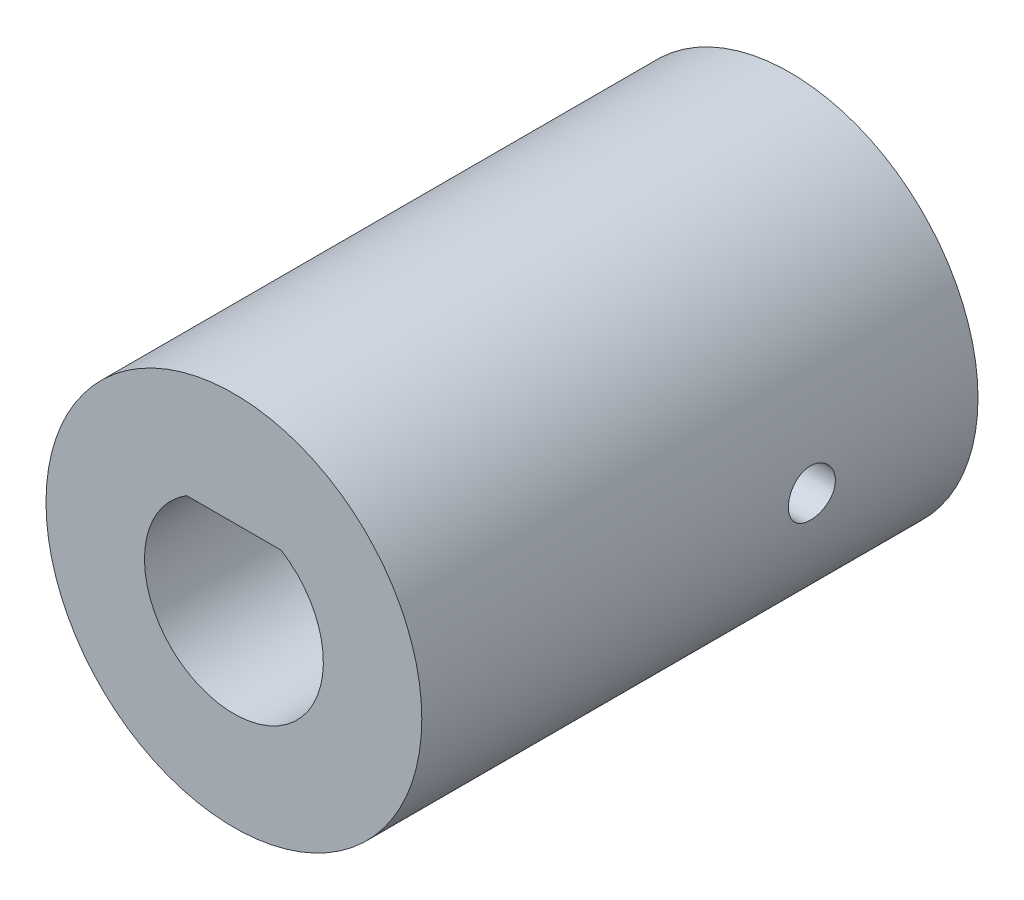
from build123d import *

# Parameters (mm, degrees)
SKETCH1_R               = 6.35
BASE_EXTRUDE_DEPTH      = 18.796
CUT_EXTRUDE1_DEPTH      = 21.831097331
CUT_EXTRUDE3_DEPTH      = 21.831097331
CUT_EXTRUDE3_DEPTH_BACK = 21.831097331
SKETCH4_R               = 0.79375


with BuildPart() as part:
    # Sketch1 → Base-Extrude (new body)
    with BuildSketch(Plane.XY):
        Circle(SKETCH1_R)
    extrude(amount=BASE_EXTRUDE_DEPTH)

    # Sketch2 → Cut-Extrude1 (cut, through all)
    with BuildSketch(Plane.XY.offset(18.796)):
        with BuildLine():
            Line((0, 2.5654), (1.598384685, 2.5654))
            ThreePointArc((1.598384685, 2.5654), (0, -3.0226), (-1.598384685, 2.5654))
            Line((-1.598384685, 2.5654), (0, 2.5654))
        make_face()
    extrude(amount=-CUT_EXTRUDE1_DEPTH, mode=Mode.SUBTRACT)

    # Sketch4 → Cut-Extrude3 (cut, two sides: drawn at the far end of the back side and taken through both)
    with BuildSketch(Plane(origin=(0, 0, 0), x_dir=(0, 0, -1), z_dir=(1, 0, 0)).offset(-CUT_EXTRUDE3_DEPTH_BACK)):
        with Locations((-5.6134, 0)):
            Circle(SKETCH4_R)
    extrude(amount=CUT_EXTRUDE3_DEPTH + CUT_EXTRUDE3_DEPTH_BACK, mode=Mode.SUBTRACT)


solid = part.part
